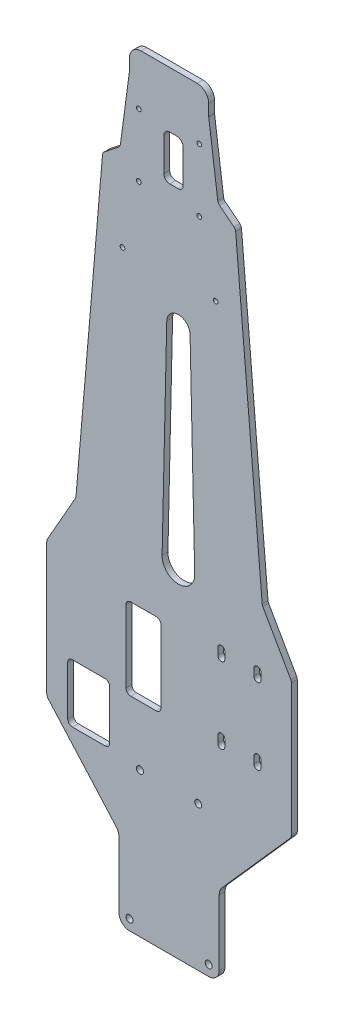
from build123d import *

# Parameters (mm, degrees)
ESQUISSE1_R          = 1.5
ESQUISSE1_R_2        = 1
BASE_EXTRUSION_DEPTH = 2.5


with BuildPart() as part:
    # Esquisse1 → Base-Extrusion (new body)
    with BuildSketch(Plane(origin=(0, 0, -2.5), x_dir=(-1, 0, 0), z_dir=(0, 0, -1))):
        with BuildLine():
            Line((22.757059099, -238.580739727), (51.99717636, -205.567704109))
            ThreePointArc((51.99717636, -205.567704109), (52.370073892, -204.950734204), (52.5, -204.241633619))
            Line((52.5, -204.241633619), (52.5, -147.528505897))
            ThreePointArc((52.5, -147.528505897), (52.433626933, -147.017539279), (52.238913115, -146.540487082))
            Line((52.238913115, -146.540487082), (40.216319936, -125.380723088))
            ThreePointArc((40.216319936, -125.380723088), (40.04524289, -124.98594755), (39.96255784, -124.563717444))
            Line((39.96255784, -124.563717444), (28.573358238, 8.145217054))
            ThreePointArc((28.573358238, 8.145217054), (28.344563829, 8.916925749), (27.830073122, 9.535941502))
            Line((27.830073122, 9.535941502), (21.62695263, 14.498437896))
            ThreePointArc((21.62695263, 14.498437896), (21.13507156, 15.076318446), (20.893886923, 15.795848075))
            Line((20.893886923, 15.795848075), (17.017544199, 44.86841851))
            ThreePointArc((17.017544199, 44.86841851), (17.00439087, 45.000291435), (17, 45.13274595))
            Line((17, 45.13274595), (17, 50))
            ThreePointArc((17, 50), (15.535533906, 53.535533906), (12, 55))
            Line((12, 55), (-12, 55))
            ThreePointArc((-12, 55), (-15.535533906, 53.535533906), (-17, 50))
            Line((-17, 50), (-17, 45.13274595))
            ThreePointArc((-17, 45.13274595), (-17.00439087, 45.000291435), (-17.017544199, 44.86841851))
            Line((-17.017544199, 44.86841851), (-20.893886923, 15.795848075))
            ThreePointArc((-20.893886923, 15.795848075), (-21.13507156, 15.076318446), (-21.62695263, 14.498437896))
            Line((-21.62695263, 14.498437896), (-27.830073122, 9.535941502))
            ThreePointArc((-27.830073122, 9.535941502), (-28.344563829, 8.916925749), (-28.573358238, 8.145217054))
            Line((-28.573358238, 8.145217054), (-39.96255784, -124.563717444))
            ThreePointArc((-39.96255784, -124.563717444), (-40.04524289, -124.98594755), (-40.216319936, -125.380723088))
            Line((-40.216319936, -125.380723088), (-52.238913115, -146.540487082))
            ThreePointArc((-52.238913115, -146.540487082), (-52.433626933, -147.017539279), (-52.5, -147.528505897))
            Line((-52.5, -147.528505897), (-52.5, -204.241633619))
            ThreePointArc((-52.5, -204.241633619), (-52.370073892, -204.950734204), (-51.99717636, -205.567704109))
            Line((-51.99717636, -205.567704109), (-22.757059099, -238.580739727))
            ThreePointArc((-22.757059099, -238.580739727), (-21.824815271, -240.123164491), (-21.5, -241.895915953))
            Line((-21.5, -241.895915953), (-21.5, -270))
            ThreePointArc((-21.5, -270), (-20.181980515, -273.181980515), (-17, -274.5))
            Line((-17, -274.5), (17, -274.5))
            ThreePointArc((17, -274.5), (20.181980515, -273.181980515), (21.5, -270))
            Line((21.5, -270), (21.5, -241.895915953))
            ThreePointArc((21.5, -241.895915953), (21.824815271, -240.123164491), (22.757059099, -238.580739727))
        make_face()
        with Locations(Location((-12.5, -212.5, 0), (0, 0, 180))):
            Circle(ESQUISSE1_R, mode=Mode.SUBTRACT)
        with Locations(Location((12.5, -212.5, 0), (0, 0, 180))):
            Circle(ESQUISSE1_R, mode=Mode.SUBTRACT)
        with Locations(Location((-17, -270, 0), (0, 0, 180))):
            Circle(ESQUISSE1_R, mode=Mode.SUBTRACT)
        with Locations(Location((17, -270, 0), (0, 0, 180))):
            Circle(ESQUISSE1_R, mode=Mode.SUBTRACT)
        with Locations(Location((-20, -22, 0), (0, 0, 180))):
            Circle(ESQUISSE1_R_2, mode=Mode.SUBTRACT)
        with Locations(Location((20, -22, 0), (0, 0, 180))):
            Circle(ESQUISSE1_R_2, mode=Mode.SUBTRACT)
        with Locations(Location((-13, 6, 0), (0, 0, 180))):
            Circle(ESQUISSE1_R_2, mode=Mode.SUBTRACT)
        with Locations(Location((13, 6, 0), (0, 0, 180))):
            Circle(ESQUISSE1_R_2, mode=Mode.SUBTRACT)
        with Locations(Location((-13, 33, 0), (0, 0, 180))):
            Circle(ESQUISSE1_R_2, mode=Mode.SUBTRACT)
        with Locations(Location((13, 33, 0), (0, 0, 180))):
            Circle(ESQUISSE1_R_2, mode=Mode.SUBTRACT)
        with BuildLine():
            Line((0.998712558, -39.886541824), (2.998197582, -127.979363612))
            ThreePointArc((2.998197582, -127.979363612), (-4, -135.138205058), (-10.998197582, -127.979363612))
            Line((-10.998197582, -127.979363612), (-8.998712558, -39.886541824))
            ThreePointArc((-8.998712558, -39.886541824), (-4, -35), (0.998712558, -39.886541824))
        make_face(mode=Mode.SUBTRACT)
        with BuildLine():
            Line((-3.251273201, 31), (-0.248726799, 31))
            ThreePointArc((-0.248726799, 31), (1.519040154, 30.267766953), (2.251273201, 28.5))
            Line((2.251273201, 28.5), (2.251273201, 14.248726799))
            ThreePointArc((2.251273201, 14.248726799), (1.519040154, 12.480959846), (-0.248726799, 11.748726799))
            Line((-0.248726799, 11.748726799), (-4, 11.748726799))
            ThreePointArc((-4, 11.748726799), (-5.414213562, 12.334513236), (-6, 13.748726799))
            Line((-6, 13.748726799), (-6, 28.251273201))
            ThreePointArc((-6, 28.251273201), (-5.19491656, 30.19491656), (-3.251273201, 31))
        make_face(mode=Mode.SUBTRACT)
        with BuildLine():
            Line((5.5, -152), (16.5, -152))
            ThreePointArc((16.5, -152), (17.914213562, -152.585786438), (18.5, -154))
            Line((18.5, -154), (18.5, -185))
            ThreePointArc((18.5, -185), (17.914213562, -186.414213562), (16.5, -187))
            Line((16.5, -187), (5.5, -187))
            ThreePointArc((5.5, -187), (4.085786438, -186.414213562), (3.5, -185))
            Line((3.5, -185), (3.5, -154))
            ThreePointArc((3.5, -154), (4.085786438, -152.585786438), (5.5, -152))
        make_face(mode=Mode.SUBTRACT)
        with BuildLine():
            Line((27.5, -186), (41.5, -186))
            ThreePointArc((41.5, -186), (42.914213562, -186.585786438), (43.5, -188))
            Line((43.5, -188), (43.5, -209))
            ThreePointArc((43.5, -209), (42.914213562, -210.414213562), (41.5, -211))
            Line((41.5, -211), (27.5, -211))
            ThreePointArc((27.5, -211), (26.085786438, -210.414213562), (25.5, -209))
            Line((25.5, -209), (25.5, -188))
            ThreePointArc((25.5, -188), (26.085786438, -186.585786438), (27.5, -186))
        make_face(mode=Mode.SUBTRACT)
        with BuildLine():
            Line((-36.4, -182.8), (-36.4, -185.8))
            ThreePointArc((-36.4, -185.8), (-37.9, -187.3), (-39.4, -185.8))
            Line((-39.4, -185.8), (-39.4, -182.8))
            ThreePointArc((-39.4, -182.8), (-37.9, -181.3), (-36.4, -182.8))
        make_face(mode=Mode.SUBTRACT)
        with BuildLine():
            Line((-20.9, -182.8), (-20.9, -185.8))
            ThreePointArc((-20.9, -185.8), (-22.4, -187.3), (-23.9, -185.8))
            Line((-23.9, -185.8), (-23.9, -182.8))
            ThreePointArc((-23.9, -182.8), (-22.4, -181.3), (-20.9, -182.8))
        make_face(mode=Mode.SUBTRACT)
        with BuildLine():
            Line((-36.4, -150.2), (-36.4, -153.2))
            ThreePointArc((-36.4, -153.2), (-37.9, -154.7), (-39.4, -153.2))
            Line((-39.4, -153.2), (-39.4, -150.2))
            ThreePointArc((-39.4, -150.2), (-37.9, -148.7), (-36.4, -150.2))
        make_face(mode=Mode.SUBTRACT)
        with BuildLine():
            Line((-20.9, -150.2), (-20.9, -153.2))
            ThreePointArc((-20.9, -153.2), (-22.4, -154.7), (-23.9, -153.2))
            Line((-23.9, -153.2), (-23.9, -150.2))
            ThreePointArc((-23.9, -150.2), (-22.4, -148.7), (-20.9, -150.2))
        make_face(mode=Mode.SUBTRACT)
    extrude(amount=-BASE_EXTRUSION_DEPTH)


solid = part.part
